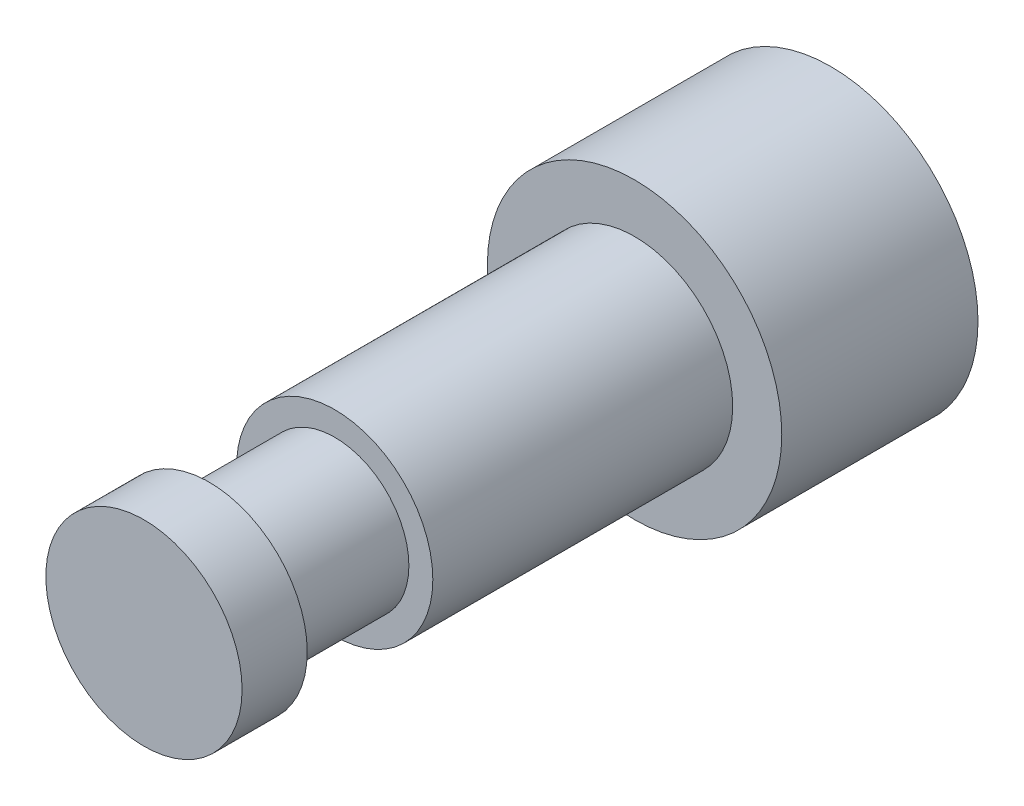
from build123d import *

# Parameters (mm, degrees)
SKETCH1_R           = 4.7625
BASE_EXTRUDE_DEPTH  = 6.35
SKETCH2_R           = 3.175
BOSS_EXTRUDE1_DEPTH = 9.7028
SKETCH3_R           = 2.4003
BOSS_EXTRUDE2_DEPTH = 4.064
SKETCH4_R           = 3.175
BOSS_EXTRUDE3_DEPTH = 2.1082


with BuildPart() as part:
    # Sketch1 → Base-Extrude (new body)
    with BuildSketch(Plane.XY):
        Circle(SKETCH1_R)
    extrude(amount=BASE_EXTRUDE_DEPTH)

    # Sketch2 → Boss-Extrude1 (add)
    with BuildSketch(Plane.XY.offset(6.35)):
        Circle(SKETCH2_R)
    extrude(amount=BOSS_EXTRUDE1_DEPTH)

    # Sketch3 → Boss-Extrude2 (add)
    with BuildSketch(Plane.XY.offset(16.0528)):
        Circle(SKETCH3_R)
    extrude(amount=BOSS_EXTRUDE2_DEPTH)

    # Sketch4 → Boss-Extrude3 (add)
    with BuildSketch(Plane.XY.offset(20.1168)):
        Circle(SKETCH4_R)
    extrude(amount=BOSS_EXTRUDE3_DEPTH)


solid = part.part
